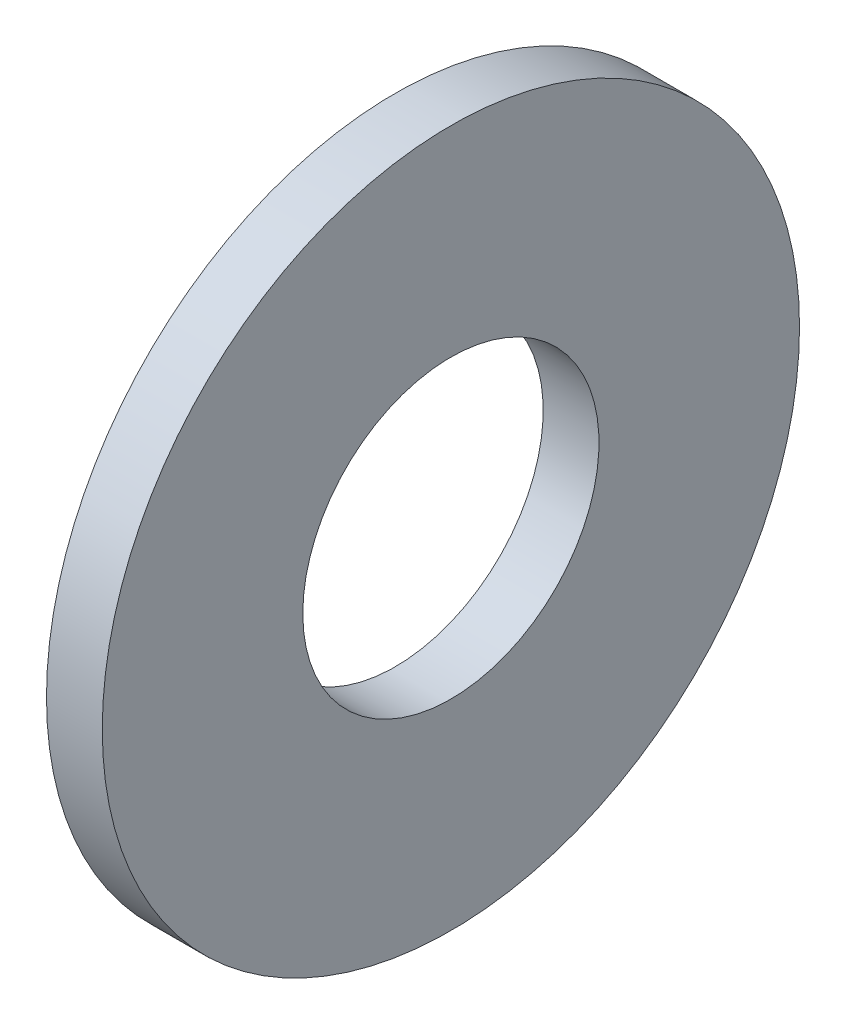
from build123d import *

# Parameters (mm, degrees)
SKETCH1_W = 2.54
SKETCH1_H = 9.1313


with BuildPart() as part:
    # Sketch1 → Base-Revolve (revolve)
    with BuildSketch(Plane.XY, mode=Mode.PRIVATE) as base_revolve_sk:
        with Locations((-1.27, 11.30935)):
            Rectangle(SKETCH1_W, SKETCH1_H)
    revolve(base_revolve_sk.sketch.rotate(Axis((-34.925, 0, 0), (1, 0, 0)), 90), axis=Axis((-34.925, 0, 0), (1, 0, 0)))


solid = part.part
